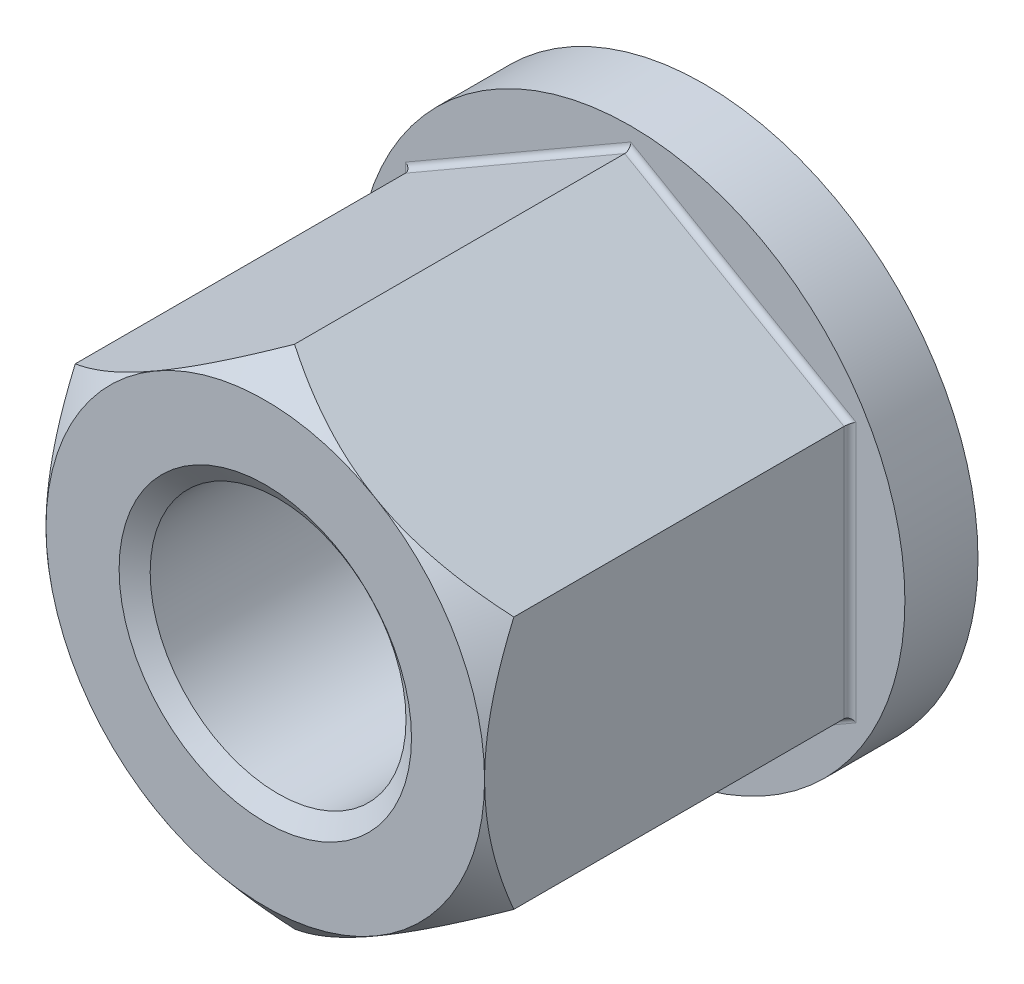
ISO-10303-21;
HEADER;
FILE_DESCRIPTION(('STEP AP214'),'2;1');
FILE_NAME('part.step','',(''),(''),'','','');
FILE_SCHEMA(('AUTOMOTIVE_DESIGN { 1 0 10303 214 1 1 1 1 }'));
ENDSEC;
DATA;
#1=APPLICATION_CONTEXT('core data for automotive mechanical design processes');
#2=APPLICATION_PROTOCOL_DEFINITION('international standard','automotive_design',2000,#1);
#3=PRODUCT_CONTEXT('',#1,'mechanical');
#4=PRODUCT('Part','Part','',(#3));
#5=PRODUCT_RELATED_PRODUCT_CATEGORY('part','',(#4));
#6=PRODUCT_DEFINITION_FORMATION('','',#4);
#7=PRODUCT_DEFINITION_CONTEXT('part definition',#1,'design');
#8=PRODUCT_DEFINITION('design','',#6,#7);
#9=PRODUCT_DEFINITION_SHAPE('','',#8);
#10=(LENGTH_UNIT() NAMED_UNIT(*) SI_UNIT(.MILLI.,.METRE.));
#11=(NAMED_UNIT(*) PLANE_ANGLE_UNIT() SI_UNIT($,.RADIAN.));
#12=(NAMED_UNIT(*) SI_UNIT($,.STERADIAN.) SOLID_ANGLE_UNIT());
#13=UNCERTAINTY_MEASURE_WITH_UNIT(LENGTH_MEASURE(1.E-05),#10,'distance_accuracy_value','');
#14=(GEOMETRIC_REPRESENTATION_CONTEXT(3) GLOBAL_UNCERTAINTY_ASSIGNED_CONTEXT((#13)) GLOBAL_UNIT_ASSIGNED_CONTEXT((#10,
#11,#12)) REPRESENTATION_CONTEXT('',''));
#15=CARTESIAN_POINT('',(0.,0.,0.));
#16=DIRECTION('',(0.,0.,1.));
#17=DIRECTION('',(1.,0.,0.));
#18=AXIS2_PLACEMENT_3D('',#15,#16,#17);
#19=CARTESIAN_POINT('',(0.,0.,-36.));
#20=DIRECTION('',(0.,0.,1.));
#21=DIRECTION('',(1.,0.,0.));
#22=AXIS2_PLACEMENT_3D('',#19,#20,#21);
#23=CYLINDRICAL_SURFACE('',#22,10.5);
#24=CARTESIAN_POINT('',(0.,0.,-1.05031130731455));
#25=DIRECTION('',(0.,0.,1.));
#26=DIRECTION('',(1.,0.,0.));
#27=AXIS2_PLACEMENT_3D('',#24,#25,#26);
#28=CIRCLE('',#27,10.5);
#29=CARTESIAN_POINT('',(10.5,0.,-1.05031130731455));
#30=VERTEX_POINT('',#29);
#31=EDGE_CURVE('E324',#30,#30,#28,.F.);
#32=ORIENTED_EDGE('',*,*,#31,.F.);
#33=EDGE_LOOP('',(#32));
#34=FACE_BOUND('',#33,.T.);
#35=CARTESIAN_POINT('',(0.,0.,-34.9242886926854));
#36=DIRECTION('',(0.,0.,-1.));
#37=DIRECTION('',(-1.,0.,0.));
#38=AXIS2_PLACEMENT_3D('',#35,#36,#37);
#39=CIRCLE('',#38,10.5);
#40=CARTESIAN_POINT('',(-10.5,0.,-34.9242886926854));
#41=VERTEX_POINT('',#40);
#42=EDGE_CURVE('E328',#41,#41,#39,.F.);
#43=ORIENTED_EDGE('',*,*,#42,.F.);
#44=EDGE_LOOP('',(#43));
#45=FACE_BOUND('',#44,.T.);
#46=ADVANCED_FACE('F43',(#34,#45),#23,.F.);
#47=CARTESIAN_POINT('',(0.,20.7846096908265,-36.));
#48=DIRECTION('',(-0.500000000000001,0.866025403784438,0.));
#49=DIRECTION('',(-0.866025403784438,-0.500000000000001,0.));
#50=AXIS2_PLACEMENT_3D('',#47,#48,#49);
#51=PLANE('',#50);
#52=DIRECTION('',(0.,0.,1.));
#53=VECTOR('',#52,1.);
#54=CARTESIAN_POINT('',(0.,20.7846096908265,-36.));
#55=LINE('',#54,#53);
#56=CARTESIAN_POINT('',(0.,20.7846096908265,-29.5));
#57=VERTEX_POINT('',#56);
#58=CARTESIAN_POINT('',(0.,20.7846096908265,-2.40000000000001));
#59=VERTEX_POINT('',#58);
#60=EDGE_CURVE('E143',#57,#59,#55,.T.);
#61=ORIENTED_EDGE('',*,*,#60,.F.);
#62=DIRECTION('',(-0.866025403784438,-0.500000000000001,0.));
#63=VECTOR('',#62,1.);
#64=CARTESIAN_POINT('',(0.,20.7846096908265,-29.5));
#65=LINE('',#64,#63);
#66=CARTESIAN_POINT('',(-18.,10.3923048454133,-29.5));
#67=VERTEX_POINT('',#66);
#68=EDGE_CURVE('E304',#57,#67,#65,.T.);
#69=ORIENTED_EDGE('',*,*,#68,.T.);
#70=DIRECTION('',(0.,0.,1.));
#71=VECTOR('',#70,1.);
#72=CARTESIAN_POINT('',(-18.,10.3923048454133,-36.));
#73=LINE('',#72,#71);
#74=CARTESIAN_POINT('',(-18.,10.3923048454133,-2.39999999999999));
#75=VERTEX_POINT('',#74);
#76=EDGE_CURVE('E411',#67,#75,#73,.T.);
#77=ORIENTED_EDGE('',*,*,#76,.T.);
#78=CARTESIAN_POINT('',(-18.0002,10.3921893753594,-2.4000995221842));
#79=CARTESIAN_POINT('',(-17.6472522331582,10.5959638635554,-2.22449760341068));
#80=CARTESIAN_POINT('',(-17.2918201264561,10.8011726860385,-2.05534790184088));
#81=CARTESIAN_POINT('',(-16.5756493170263,11.2146540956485,-1.7320405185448));
#82=CARTESIAN_POINT('',(-16.2149076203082,11.4229284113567,-1.57789170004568));
#83=CARTESIAN_POINT('',(-15.4863498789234,11.8435614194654,-1.286146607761));
#84=CARTESIAN_POINT('',(-15.1185072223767,12.055935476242,-1.14863831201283));
#85=CARTESIAN_POINT('',(-14.3777064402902,12.4836370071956,-0.893572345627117));
#86=CARTESIAN_POINT('',(-14.0047491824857,12.6989639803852,-0.77601133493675));
#87=CARTESIAN_POINT('',(-13.2607541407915,13.1285097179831,-0.565222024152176));
#88=CARTESIAN_POINT('',(-12.8898014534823,13.3426793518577,-0.471595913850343));
#89=CARTESIAN_POINT('',(-12.1439277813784,13.7733097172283,-0.308235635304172));
#90=CARTESIAN_POINT('',(-11.7690066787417,13.9897705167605,-0.238502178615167));
#91=CARTESIAN_POINT('',(-11.0170489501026,14.4239135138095,-0.124970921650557));
#92=CARTESIAN_POINT('',(-10.6400188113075,14.6415919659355,-0.0811162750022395));
#93=CARTESIAN_POINT('',(-9.88433556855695,15.0778858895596,-0.0204252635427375));
#94=CARTESIAN_POINT('',(-9.50568258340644,15.2965012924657,-0.00358695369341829));
#95=CARTESIAN_POINT('',(-8.80111206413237,15.7032852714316,0.00212894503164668));
#96=CARTESIAN_POINT('',(-8.47521263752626,15.8914433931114,-0.00541797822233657));
#97=CARTESIAN_POINT('',(-7.82424565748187,16.2672793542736,-0.0407036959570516));
#98=CARTESIAN_POINT('',(-7.4991780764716,16.4549572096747,-0.0684418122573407));
#99=CARTESIAN_POINT('',(-6.8505129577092,16.8294641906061,-0.143507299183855));
#100=CARTESIAN_POINT('',(-6.52691668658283,17.0162925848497,-0.190849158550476));
#101=CARTESIAN_POINT('',(-5.88218255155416,17.3885300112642,-0.304106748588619));
#102=CARTESIAN_POINT('',(-5.56104472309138,17.5739390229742,-0.370022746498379));
#103=CARTESIAN_POINT('',(-4.9217585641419,17.9430310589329,-0.519150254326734));
#104=CARTESIAN_POINT('',(-4.60361068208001,18.1267138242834,-0.602364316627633));
#105=CARTESIAN_POINT('',(-3.9707224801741,18.4921119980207,-0.784638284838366));
#106=CARTESIAN_POINT('',(-3.65598267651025,18.6738271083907,-0.883700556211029));
#107=CARTESIAN_POINT('',(-2.71756887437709,19.2156205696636,-1.20228324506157));
#108=CARTESIAN_POINT('',(-2.09929390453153,19.5725817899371,-1.44329801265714));
#109=CARTESIAN_POINT('',(-1.23771271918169,20.0700159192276,-1.81550682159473));
#110=CARTESIAN_POINT('',(-0.988042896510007,20.2141628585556,-1.9277719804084));
#111=CARTESIAN_POINT('',(-0.491802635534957,20.5006673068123,-2.15901832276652));
#112=CARTESIAN_POINT('',(-0.245225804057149,20.6430285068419,-2.27798119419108));
#113=CARTESIAN_POINT('',(0.000200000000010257,20.7847251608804,-2.40009952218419));
#114=B_SPLINE_CURVE_WITH_KNOTS('',3,(#78,#79,#80,#81,#82,#83,#84,#85,#86,#87,#88,#89,#90,#91,
#92,#93,#94,#95,#96,#97,#98,#99,#100,#101,#102,#103,#104,#105,#106,#107,#108,#109,#110,#111,
#112,#113),.UNSPECIFIED.,.F.,.F.,(4,2,2,2,2,2,2,2,2,2,2,2,2,2,2,2,2,4),(0.,1.33137657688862,
2.66353507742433,4.00245455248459,5.34114961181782,6.65588719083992,7.97066392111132,
9.28254170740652,10.594325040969,11.7229654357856,12.8515679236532,13.9810060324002,
15.1104603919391,16.2400815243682,17.3698714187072,19.6280163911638,20.556111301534,
21.4817815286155),.UNSPECIFIED.);
#115=CARTESIAN_POINT('',(-9.00000000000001,15.5884572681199,0.));
#116=VERTEX_POINT('',#115);
#117=EDGE_CURVE('E153',#75,#116,#114,.T.);
#118=ORIENTED_EDGE('',*,*,#117,.T.);
#119=EDGE_CURVE('E161',#116,#59,#114,.T.);
#120=ORIENTED_EDGE('',*,*,#119,.T.);
#121=EDGE_LOOP('',(#61,#69,#77,#118,#120));
#122=FACE_BOUND('',#121,.T.);
#123=ADVANCED_FACE('F238',(#122),#51,.T.);
#124=CARTESIAN_POINT('',(18.,10.3923048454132,-36.));
#125=DIRECTION('',(0.500000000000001,0.866025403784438,0.));
#126=DIRECTION('',(-0.866025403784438,0.500000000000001,0.));
#127=AXIS2_PLACEMENT_3D('',#124,#125,#126);
#128=PLANE('',#127);
#129=DIRECTION('',(0.,0.,1.));
#130=VECTOR('',#129,1.);
#131=CARTESIAN_POINT('',(18.,10.3923048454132,-36.));
#132=LINE('',#131,#130);
#133=CARTESIAN_POINT('',(18.,10.3923048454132,-29.5));
#134=VERTEX_POINT('',#133);
#135=CARTESIAN_POINT('',(18.,10.3923048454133,-2.40000000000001));
#136=VERTEX_POINT('',#135);
#137=EDGE_CURVE('E132',#134,#136,#132,.T.);
#138=ORIENTED_EDGE('',*,*,#137,.F.);
#139=DIRECTION('',(-0.866025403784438,0.500000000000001,0.));
#140=VECTOR('',#139,1.);
#141=CARTESIAN_POINT('',(18.,10.3923048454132,-29.5));
#142=LINE('',#141,#140);
#143=EDGE_CURVE('E357',#134,#57,#142,.T.);
#144=ORIENTED_EDGE('',*,*,#143,.T.);
#145=ORIENTED_EDGE('',*,*,#60,.T.);
#146=CARTESIAN_POINT('',(-0.000199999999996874,20.7847251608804,-2.40009952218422));
#147=CARTESIAN_POINT('',(0.352747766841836,20.5809506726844,-2.22449760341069));
#148=CARTESIAN_POINT('',(0.708179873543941,20.3757418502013,-2.05534790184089));
#149=CARTESIAN_POINT('',(1.42435068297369,19.9622604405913,-1.73204051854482));
#150=CARTESIAN_POINT('',(1.78509237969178,19.7539861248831,-1.57789170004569));
#151=CARTESIAN_POINT('',(2.51365012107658,19.3333531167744,-1.28614660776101));
#152=CARTESIAN_POINT('',(2.88149277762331,19.1209790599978,-1.14863831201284));
#153=CARTESIAN_POINT('',(3.62229355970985,18.6932775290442,-0.893572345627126));
#154=CARTESIAN_POINT('',(3.99525081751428,18.4779505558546,-0.776011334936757));
#155=CARTESIAN_POINT('',(4.7392458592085,18.0484048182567,-0.56522202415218));
#156=CARTESIAN_POINT('',(5.1101985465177,17.8342351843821,-0.471595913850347));
#157=CARTESIAN_POINT('',(5.85607221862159,17.4036048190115,-0.308235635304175));
#158=CARTESIAN_POINT('',(6.23099332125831,17.1871440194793,-0.23850217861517));
#159=CARTESIAN_POINT('',(6.98295104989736,16.7530010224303,-0.124970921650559));
#160=CARTESIAN_POINT('',(7.35998118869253,16.5353225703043,-0.0811162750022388));
#161=CARTESIAN_POINT('',(8.11566443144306,16.0990286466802,-0.0204252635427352));
#162=CARTESIAN_POINT('',(8.49431741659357,15.8804132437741,-0.00358695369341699));
#163=CARTESIAN_POINT('',(9.19888793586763,15.4736292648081,0.00212894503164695));
#164=CARTESIAN_POINT('',(9.52478736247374,15.2854711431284,-0.00541797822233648));
#165=CARTESIAN_POINT('',(10.1757543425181,14.9096351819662,-0.0407036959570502));
#166=CARTESIAN_POINT('',(10.5008219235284,14.7219573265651,-0.0684418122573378));
#167=CARTESIAN_POINT('',(11.1494870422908,14.3474503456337,-0.14350729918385));
#168=CARTESIAN_POINT('',(11.4730833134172,14.1606219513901,-0.19084915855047));
#169=CARTESIAN_POINT('',(12.1178174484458,13.7883845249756,-0.304106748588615));
#170=CARTESIAN_POINT('',(12.4389552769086,13.6029755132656,-0.370022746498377));
#171=CARTESIAN_POINT('',(13.0782414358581,13.2338834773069,-0.519150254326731));
#172=CARTESIAN_POINT('',(13.39638931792,13.0502007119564,-0.602364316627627));
#173=CARTESIAN_POINT('',(14.0292775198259,12.6848025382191,-0.784638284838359));
#174=CARTESIAN_POINT('',(14.3440173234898,12.503087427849,-0.883700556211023));
#175=CARTESIAN_POINT('',(15.2824311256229,11.9612939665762,-1.20228324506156));
#176=CARTESIAN_POINT('',(15.9007060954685,11.6043327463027,-1.44329801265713));
#177=CARTESIAN_POINT('',(16.7622872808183,11.1068986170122,-1.81550682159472));
#178=CARTESIAN_POINT('',(17.01195710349,10.9627516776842,-1.92777198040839));
#179=CARTESIAN_POINT('',(17.508197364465,10.6762472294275,-2.15901832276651));
#180=CARTESIAN_POINT('',(17.7547741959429,10.5338860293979,-2.27798119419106));
#181=CARTESIAN_POINT('',(18.0002,10.3921893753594,-2.40009952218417));
#182=B_SPLINE_CURVE_WITH_KNOTS('',3,(#146,#147,#148,#149,#150,#151,#152,#153,#154,#155,#156,
#157,#158,#159,#160,#161,#162,#163,#164,#165,#166,#167,#168,#169,#170,#171,#172,#173,#174,#175,
#176,#177,#178,#179,#180,#181),.UNSPECIFIED.,.F.,.F.,(4,2,2,2,2,2,2,2,2,2,2,2,2,2,2,2,2,4),(0.,
1.33137657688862,2.66353507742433,4.00245455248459,5.34114961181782,6.65588719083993,
7.97066392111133,9.28254170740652,10.594325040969,11.7229654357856,12.8515679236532,
13.9810060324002,15.1104603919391,16.2400815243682,17.3698714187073,19.6280163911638,
20.556111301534,21.4817815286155),.UNSPECIFIED.);
#183=CARTESIAN_POINT('',(9.00000000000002,15.5884572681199,0.));
#184=VERTEX_POINT('',#183);
#185=EDGE_CURVE('E159',#59,#184,#182,.T.);
#186=ORIENTED_EDGE('',*,*,#185,.T.);
#187=EDGE_CURVE('E148',#184,#136,#182,.T.);
#188=ORIENTED_EDGE('',*,*,#187,.T.);
#189=EDGE_LOOP('',(#138,#144,#145,#186,#188));
#190=FACE_BOUND('',#189,.T.);
#191=ADVANCED_FACE('F157',(#190),#128,.T.);
#192=CARTESIAN_POINT('',(18.,10.3923048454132,-36.));
#193=DIRECTION('',(-1.,0.,0.));
#194=DIRECTION('',(0.,0.,1.));
#195=AXIS2_PLACEMENT_3D('',#192,#193,#194);
#196=PLANE('',#195);
#197=DIRECTION('',(0.,0.,1.));
#198=VECTOR('',#197,1.);
#199=CARTESIAN_POINT('',(18.,-10.3923048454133,-36.));
#200=LINE('',#199,#198);
#201=CARTESIAN_POINT('',(18.,-10.3923048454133,-29.5));
#202=VERTEX_POINT('',#201);
#203=CARTESIAN_POINT('',(18.,-10.3923048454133,-2.40000000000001));
#204=VERTEX_POINT('',#203);
#205=EDGE_CURVE('E144',#202,#204,#200,.T.);
#206=ORIENTED_EDGE('',*,*,#205,.F.);
#207=DIRECTION('',(0.,-1.,0.));
#208=VECTOR('',#207,1.);
#209=CARTESIAN_POINT('',(18.,10.3923048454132,-29.5));
#210=LINE('',#209,#208);
#211=EDGE_CURVE('E139',#202,#134,#210,.F.);
#212=ORIENTED_EDGE('',*,*,#211,.T.);
#213=ORIENTED_EDGE('',*,*,#137,.T.);
#214=CARTESIAN_POINT('',(18.,-23.004007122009,-9.66109067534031));
#215=CARTESIAN_POINT('',(18.,-22.7130247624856,-9.46358121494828));
#216=CARTESIAN_POINT('',(18.,-22.4213849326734,-9.26704104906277));
#217=CARTESIAN_POINT('',(18.,-21.8366744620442,-8.87609133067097));
#218=CARTESIAN_POINT('',(18.,-21.5436037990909,-8.68168181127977));
#219=CARTESIAN_POINT('',(18.,-20.6619640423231,-8.1018666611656));
#220=CARTESIAN_POINT('',(18.,-20.0710871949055,-7.71995612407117));
#221=CARTESIAN_POINT('',(18.,-18.8779599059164,-6.96474937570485));
#222=CARTESIAN_POINT('',(18.,-18.275658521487,-6.59153346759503));
#223=CARTESIAN_POINT('',(18.,-17.0626062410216,-5.85913721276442));
#224=CARTESIAN_POINT('',(18.,-16.4518558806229,-5.4999559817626));
#225=CARTESIAN_POINT('',(18.,-15.187049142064,-4.77989017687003));
#226=CARTESIAN_POINT('',(18.,-14.53244086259,-4.41997024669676));
#227=CARTESIAN_POINT('',(18.,-13.2102587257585,-3.72436997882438));
#228=CARTESIAN_POINT('',(18.,-12.5426829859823,-3.38869319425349));
#229=CARTESIAN_POINT('',(18.,-11.1945975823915,-2.74913403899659));
#230=CARTESIAN_POINT('',(18.,-10.5141280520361,-2.44516764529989));
#231=CARTESIAN_POINT('',(18.,-9.13701896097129,-1.87650341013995));
#232=CARTESIAN_POINT('',(18.,-8.4403862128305,-1.61178935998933));
#233=CARTESIAN_POINT('',(18.,-7.39269202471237,-1.25527340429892));
#234=CARTESIAN_POINT('',(18.,-7.04803834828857,-1.14452672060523));
#235=CARTESIAN_POINT('',(18.,-6.35479865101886,-0.936059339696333));
#236=CARTESIAN_POINT('',(18.,-6.00621274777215,-0.838338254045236));
#237=CARTESIAN_POINT('',(18.,-5.30529131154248,-0.65725116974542));
#238=CARTESIAN_POINT('',(18.,-4.95295551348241,-0.573886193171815));
#239=CARTESIAN_POINT('',(18.,-4.24494415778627,-0.422830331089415));
#240=CARTESIAN_POINT('',(18.,-3.88926880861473,-0.355138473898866));
#241=CARTESIAN_POINT('',(18.,-3.1817425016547,-0.237715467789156));
#242=CARTESIAN_POINT('',(18.,-2.82994329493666,-0.187673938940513));
#243=CARTESIAN_POINT('',(18.,-2.12431777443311,-0.10476176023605));
#244=CARTESIAN_POINT('',(18.,-1.77049147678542,-0.0718909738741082));
#245=CARTESIAN_POINT('',(18.,-1.06165755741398,-0.023977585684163));
#246=CARTESIAN_POINT('',(18.,-0.706650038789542,-0.00893346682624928));
#247=CARTESIAN_POINT('',(18.,0.00366918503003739,0.0030183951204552));
#248=CARTESIAN_POINT('',(18.,0.358980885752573,-7.35995509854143E-05));
#249=CARTESIAN_POINT('',(18.,1.04524350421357,-0.023514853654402));
#250=CARTESIAN_POINT('',(18.,1.37623509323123,-0.0426966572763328));
#251=CARTESIAN_POINT('',(18.,2.03695728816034,-0.0964469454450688));
#252=CARTESIAN_POINT('',(18.,2.36668791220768,-0.131015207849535));
#253=CARTESIAN_POINT('',(18.,3.02426460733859,-0.214948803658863));
#254=CARTESIAN_POINT('',(18.,3.35211059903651,-0.264314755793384));
#255=CARTESIAN_POINT('',(18.,4.00537756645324,-0.377054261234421));
#256=CARTESIAN_POINT('',(18.,4.33079851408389,-0.440427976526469));
#257=CARTESIAN_POINT('',(18.,4.98553766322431,-0.581709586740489));
#258=CARTESIAN_POINT('',(18.,5.31479639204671,-0.659892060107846));
#259=CARTESIAN_POINT('',(18.,5.97006378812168,-0.828821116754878));
#260=CARTESIAN_POINT('',(18.,6.29607242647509,-0.919567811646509));
#261=CARTESIAN_POINT('',(18.,6.94458276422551,-1.1125074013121));
#262=CARTESIAN_POINT('',(18.,7.26708534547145,-1.21469734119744));
#263=CARTESIAN_POINT('',(18.,7.90858491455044,-1.42946670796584));
#264=CARTESIAN_POINT('',(18.,8.22758199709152,-1.54204585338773));
#265=CARTESIAN_POINT('',(18.,9.12558604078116,-1.8739550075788));
#266=CARTESIAN_POINT('',(18.,9.7005376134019,-2.10430079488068));
#267=CARTESIAN_POINT('',(18.,10.8394982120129,-2.59076896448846));
#268=CARTESIAN_POINT('',(18.,11.4035040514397,-2.8468987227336));
#269=CARTESIAN_POINT('',(18.,12.5220422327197,-3.38049628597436));
#270=CARTESIAN_POINT('',(18.,13.0765634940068,-3.65798720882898));
#271=CARTESIAN_POINT('',(18.,14.1765320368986,-4.23020882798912));
#272=CARTESIAN_POINT('',(18.,14.7219801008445,-4.52493802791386));
#273=CARTESIAN_POINT('',(18.,15.80820393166,-5.13042229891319));
#274=CARTESIAN_POINT('',(18.,16.3489315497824,-5.44126344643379));
#275=CARTESIAN_POINT('',(18.,17.4233654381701,-6.07483951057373));
#276=CARTESIAN_POINT('',(18.,17.9570715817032,-6.39757464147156));
#277=CARTESIAN_POINT('',(18.,19.0180561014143,-7.05276792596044));
#278=CARTESIAN_POINT('',(18.,19.5453379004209,-7.38522054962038));
#279=CARTESIAN_POINT('',(18.,20.5945560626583,-8.0584316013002));
#280=CARTESIAN_POINT('',(18.,21.1164924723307,-8.39918995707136));
#281=CARTESIAN_POINT('',(18.,22.1043731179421,-9.05372841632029));
#282=CARTESIAN_POINT('',(18.,22.5707554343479,-9.36684845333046));
#283=CARTESIAN_POINT('',(18.,23.5001598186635,-9.99803991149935));
#284=CARTESIAN_POINT('',(18.,23.9631818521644,-10.3161113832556));
#285=CARTESIAN_POINT('',(18.,25.3478989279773,-11.2768419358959));
#286=CARTESIAN_POINT('',(18.,26.2651309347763,-11.925941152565));
#287=CARTESIAN_POINT('',(18.,27.6278073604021,-12.9051375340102));
#288=CARTESIAN_POINT('',(18.,28.076854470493,-13.2302516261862));
#289=CARTESIAN_POINT('',(18.,28.9728653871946,-13.8833432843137));
#290=CARTESIAN_POINT('',(18.,29.4198291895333,-14.2113208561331));
#291=CARTESIAN_POINT('',(18.,30.3117649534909,-14.8697271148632));
#292=CARTESIAN_POINT('',(18.,30.7567374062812,-15.2001551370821));
#293=CARTESIAN_POINT('',(18.,31.6449810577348,-15.8632811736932));
#294=CARTESIAN_POINT('',(18.,32.0882522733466,-16.1959791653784));
#295=CARTESIAN_POINT('',(18.,32.5307636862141,-16.5296824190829));
#296=B_SPLINE_CURVE_WITH_KNOTS('',3,(#214,#215,#216,#217,#218,#219,#220,#221,#222,#223,#224,
#225,#226,#227,#228,#229,#230,#231,#232,#233,#234,#235,#236,#237,#238,#239,#240,#241,#242,#243,
#244,#245,#246,#247,#248,#249,#250,#251,#252,#253,#254,#255,#256,#257,#258,#259,#260,#261,#262,
#263,#264,#265,#266,#267,#268,#269,#270,#271,#272,#273,#274,#275,#276,#277,#278,#279,#280,#281,
#282,#283,#284,#285,#286,#287,#288,#289,#290,#291,#292,#293,#294,#295),.UNSPECIFIED.,.F.,.F.,(4,
2,2,2,2,2,2,2,2,2,2,2,2,2,2,2,2,2,2,2,2,2,2,2,2,2,2,2,2,2,2,2,2,2,2,2,2,2,2,2,4),(0.,
1.05504447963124,2.11010533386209,4.22066252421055,6.34618802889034,8.4715793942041,
10.7122708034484,12.9532899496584,15.1882116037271,17.4222077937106,18.5080274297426,
19.5938146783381,20.6796791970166,21.7654763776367,22.8310967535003,23.8967086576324,
24.9622298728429,26.0277356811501,27.0220130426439,28.0162760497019,29.0105806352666,
30.0048967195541,31.0198683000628,32.0348488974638,33.0495680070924,34.0642596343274,
35.9215460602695,37.779365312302,39.6392242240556,41.4989219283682,43.3698570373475,
45.2408258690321,47.1107499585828,48.9806577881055,50.6658546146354,52.3510686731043,
55.7219077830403,57.3850561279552,59.0482078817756,60.7109238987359,62.3736233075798),.UNSPECIFIED.);
#297=CARTESIAN_POINT('',(18.,0.,0.));
#298=VERTEX_POINT('',#297);
#299=EDGE_CURVE('E137',#298,#136,#296,.T.);
#300=ORIENTED_EDGE('',*,*,#299,.F.);
#301=EDGE_CURVE('E155',#204,#298,#296,.T.);
#302=ORIENTED_EDGE('',*,*,#301,.F.);
#303=EDGE_LOOP('',(#206,#212,#213,#300,#302));
#304=FACE_BOUND('',#303,.T.);
#305=ADVANCED_FACE('F135',(#304),#196,.F.);
#306=CARTESIAN_POINT('',(0.,-20.7846096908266,-36.));
#307=DIRECTION('',(0.500000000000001,-0.866025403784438,0.));
#308=DIRECTION('',(0.866025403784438,0.500000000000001,0.));
#309=AXIS2_PLACEMENT_3D('',#306,#307,#308);
#310=PLANE('',#309);
#311=DIRECTION('',(0.,0.,1.));
#312=VECTOR('',#311,1.);
#313=CARTESIAN_POINT('',(0.,-20.7846096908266,-36.));
#314=LINE('',#313,#312);
#315=CARTESIAN_POINT('',(0.,-20.7846096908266,-29.5));
#316=VERTEX_POINT('',#315);
#317=CARTESIAN_POINT('',(0.,-20.7846096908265,-2.40000000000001));
#318=VERTEX_POINT('',#317);
#319=EDGE_CURVE('E319',#316,#318,#314,.T.);
#320=ORIENTED_EDGE('',*,*,#319,.F.);
#321=DIRECTION('',(0.866025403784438,0.500000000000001,0.));
#322=VECTOR('',#321,1.);
#323=CARTESIAN_POINT('',(0.,-20.7846096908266,-29.5));
#324=LINE('',#323,#322);
#325=EDGE_CURVE('E354',#316,#202,#324,.T.);
#326=ORIENTED_EDGE('',*,*,#325,.T.);
#327=ORIENTED_EDGE('',*,*,#205,.T.);
#328=CARTESIAN_POINT('',(18.0002,-10.3921893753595,-2.40009952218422));
#329=CARTESIAN_POINT('',(17.6472522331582,-10.5959638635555,-2.2244976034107));
#330=CARTESIAN_POINT('',(17.2918201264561,-10.8011726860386,-2.0553479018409));
#331=CARTESIAN_POINT('',(16.5756493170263,-11.2146540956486,-1.73204051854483));
#332=CARTESIAN_POINT('',(16.2149076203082,-11.4229284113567,-1.5778917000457));
#333=CARTESIAN_POINT('',(15.4863498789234,-11.8435614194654,-1.28614660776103));
#334=CARTESIAN_POINT('',(15.1185072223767,-12.0559354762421,-1.14863831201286));
#335=CARTESIAN_POINT('',(14.3777064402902,-12.4836370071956,-0.893572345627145));
#336=CARTESIAN_POINT('',(14.0047491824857,-12.6989639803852,-0.776011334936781));
#337=CARTESIAN_POINT('',(13.2607541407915,-13.1285097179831,-0.565222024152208));
#338=CARTESIAN_POINT('',(12.8898014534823,-13.3426793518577,-0.471595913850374));
#339=CARTESIAN_POINT('',(12.1439277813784,-13.7733097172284,-0.308235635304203));
#340=CARTESIAN_POINT('',(11.7690066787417,-13.9897705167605,-0.2385021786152));
#341=CARTESIAN_POINT('',(11.0170489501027,-14.4239135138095,-0.124970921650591));
#342=CARTESIAN_POINT('',(10.6400188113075,-14.6415919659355,-0.0811162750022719));
#343=CARTESIAN_POINT('',(9.88433556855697,-15.0778858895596,-0.020425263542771));
#344=CARTESIAN_POINT('',(9.50568258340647,-15.2965012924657,-0.00358695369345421));
#345=CARTESIAN_POINT('',(8.8011120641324,-15.7032852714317,0.00212894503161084));
#346=CARTESIAN_POINT('',(8.47521263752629,-15.8914433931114,-0.00541797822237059));
#347=CARTESIAN_POINT('',(7.8242456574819,-16.2672793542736,-0.0407036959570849));
#348=CARTESIAN_POINT('',(7.49917807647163,-16.4549572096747,-0.0684418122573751));
#349=CARTESIAN_POINT('',(6.85051295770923,-16.8294641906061,-0.143507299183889));
#350=CARTESIAN_POINT('',(6.52691668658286,-17.0162925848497,-0.190849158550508));
#351=CARTESIAN_POINT('',(5.88218255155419,-17.3885300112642,-0.30410674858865));
#352=CARTESIAN_POINT('',(5.56104472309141,-17.5739390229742,-0.370022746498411));
#353=CARTESIAN_POINT('',(4.92175856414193,-17.9430310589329,-0.519150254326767));
#354=CARTESIAN_POINT('',(4.60361068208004,-18.1267138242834,-0.602364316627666));
#355=CARTESIAN_POINT('',(3.97072248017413,-18.4921119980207,-0.784638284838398));
#356=CARTESIAN_POINT('',(3.65598267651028,-18.6738271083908,-0.883700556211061));
#357=CARTESIAN_POINT('',(2.71756887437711,-19.2156205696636,-1.20228324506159));
#358=CARTESIAN_POINT('',(2.09929390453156,-19.5725817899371,-1.44329801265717));
#359=CARTESIAN_POINT('',(1.23771271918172,-20.0700159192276,-1.81550682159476));
#360=CARTESIAN_POINT('',(0.988042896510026,-20.2141628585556,-1.92777198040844));
#361=CARTESIAN_POINT('',(0.491802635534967,-20.5006673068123,-2.15901832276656));
#362=CARTESIAN_POINT('',(0.245225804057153,-20.6430285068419,-2.27798119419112));
#363=CARTESIAN_POINT('',(-0.000200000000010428,-20.7847251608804,-2.40009952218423));
#364=B_SPLINE_CURVE_WITH_KNOTS('',3,(#328,#329,#330,#331,#332,#333,#334,#335,#336,#337,#338,
#339,#340,#341,#342,#343,#344,#345,#346,#347,#348,#349,#350,#351,#352,#353,#354,#355,#356,#357,
#358,#359,#360,#361,#362,#363),.UNSPECIFIED.,.F.,.F.,(4,2,2,2,2,2,2,2,2,2,2,2,2,2,2,2,2,4),(0.,
1.33137657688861,2.66353507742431,4.00245455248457,5.3411496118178,6.65588719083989,
7.97066392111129,9.28254170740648,10.594325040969,11.7229654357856,12.8515679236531,
13.9810060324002,15.1104603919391,16.2400815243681,17.3698714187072,19.6280163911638,
20.556111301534,21.4817815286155),.UNSPECIFIED.);
#365=CARTESIAN_POINT('',(9.00000000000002,-15.5884572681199,0.));
#366=VERTEX_POINT('',#365);
#367=EDGE_CURVE('E224',#204,#366,#364,.T.);
#368=ORIENTED_EDGE('',*,*,#367,.T.);
#369=EDGE_CURVE('E214',#366,#318,#364,.T.);
#370=ORIENTED_EDGE('',*,*,#369,.T.);
#371=EDGE_LOOP('',(#320,#326,#327,#368,#370));
#372=FACE_BOUND('',#371,.T.);
#373=ADVANCED_FACE('F227',(#372),#310,.T.);
#374=CARTESIAN_POINT('',(-18.,-10.3923048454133,-36.));
#375=DIRECTION('',(-0.500000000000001,-0.866025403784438,0.));
#376=DIRECTION('',(0.866025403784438,-0.500000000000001,0.));
#377=AXIS2_PLACEMENT_3D('',#374,#375,#376);
#378=PLANE('',#377);
#379=DIRECTION('',(0.,0.,1.));
#380=VECTOR('',#379,1.);
#381=CARTESIAN_POINT('',(-18.,-10.3923048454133,-36.));
#382=LINE('',#381,#380);
#383=CARTESIAN_POINT('',(-18.,-10.3923048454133,-29.5));
#384=VERTEX_POINT('',#383);
#385=CARTESIAN_POINT('',(-18.,-10.3923048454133,-2.40000000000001));
#386=VERTEX_POINT('',#385);
#387=EDGE_CURVE('E414',#384,#386,#382,.T.);
#388=ORIENTED_EDGE('',*,*,#387,.F.);
#389=DIRECTION('',(0.866025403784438,-0.500000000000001,0.));
#390=VECTOR('',#389,1.);
#391=CARTESIAN_POINT('',(-18.,-10.3923048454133,-29.5));
#392=LINE('',#391,#390);
#393=EDGE_CURVE('E52',#384,#316,#392,.T.);
#394=ORIENTED_EDGE('',*,*,#393,.T.);
#395=ORIENTED_EDGE('',*,*,#319,.T.);
#396=CARTESIAN_POINT('',(0.000199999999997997,-20.7847251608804,-2.40009952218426));
#397=CARTESIAN_POINT('',(-0.352747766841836,-20.5809506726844,-2.22449760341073));
#398=CARTESIAN_POINT('',(-0.708179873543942,-20.3757418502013,-2.05534790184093));
#399=CARTESIAN_POINT('',(-1.42435068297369,-19.9622604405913,-1.73204051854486));
#400=CARTESIAN_POINT('',(-1.78509237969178,-19.7539861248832,-1.57789170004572));
#401=CARTESIAN_POINT('',(-2.51365012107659,-19.3333531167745,-1.28614660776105));
#402=CARTESIAN_POINT('',(-2.88149277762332,-19.1209790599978,-1.14863831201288));
#403=CARTESIAN_POINT('',(-3.62229355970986,-18.6932775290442,-0.893572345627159));
#404=CARTESIAN_POINT('',(-3.9952508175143,-18.4779505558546,-0.776011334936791));
#405=CARTESIAN_POINT('',(-4.73924585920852,-18.0484048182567,-0.565222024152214));
#406=CARTESIAN_POINT('',(-5.11019854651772,-17.8342351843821,-0.471595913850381));
#407=CARTESIAN_POINT('',(-5.85607221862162,-17.4036048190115,-0.308235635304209));
#408=CARTESIAN_POINT('',(-6.23099332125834,-17.1871440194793,-0.238502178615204));
#409=CARTESIAN_POINT('',(-6.98295104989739,-16.7530010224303,-0.124970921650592));
#410=CARTESIAN_POINT('',(-7.35998118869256,-16.5353225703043,-0.0811162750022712));
#411=CARTESIAN_POINT('',(-8.1156644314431,-16.0990286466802,-0.0204252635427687));
#412=CARTESIAN_POINT('',(-8.4943174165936,-15.8804132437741,-0.00358695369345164));
#413=CARTESIAN_POINT('',(-9.19888793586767,-15.4736292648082,0.00212894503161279));
#414=CARTESIAN_POINT('',(-9.52478736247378,-15.2854711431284,-0.00541797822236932));
#415=CARTESIAN_POINT('',(-10.1757543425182,-14.9096351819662,-0.0407036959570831));
#416=CARTESIAN_POINT('',(-10.5008219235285,-14.7219573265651,-0.068441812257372));
#417=CARTESIAN_POINT('',(-11.1494870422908,-14.3474503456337,-0.143507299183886));
#418=CARTESIAN_POINT('',(-11.4730833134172,-14.1606219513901,-0.190849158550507));
#419=CARTESIAN_POINT('',(-12.1178174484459,-13.7883845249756,-0.304106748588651));
#420=CARTESIAN_POINT('',(-12.4389552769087,-13.6029755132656,-0.370022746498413));
#421=CARTESIAN_POINT('',(-13.0782414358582,-13.2338834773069,-0.519150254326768));
#422=CARTESIAN_POINT('',(-13.3963893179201,-13.0502007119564,-0.602364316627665));
#423=CARTESIAN_POINT('',(-14.029277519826,-12.6848025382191,-0.784638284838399));
#424=CARTESIAN_POINT('',(-14.3440173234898,-12.5030874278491,-0.883700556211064));
#425=CARTESIAN_POINT('',(-15.282431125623,-11.9612939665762,-1.2022832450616));
#426=CARTESIAN_POINT('',(-15.9007060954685,-11.6043327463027,-1.44329801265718));
#427=CARTESIAN_POINT('',(-16.7622872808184,-11.1068986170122,-1.81550682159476));
#428=CARTESIAN_POINT('',(-17.01195710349,-10.9627516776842,-1.92777198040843));
#429=CARTESIAN_POINT('',(-17.5081973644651,-10.6762472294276,-2.15901832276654));
#430=CARTESIAN_POINT('',(-17.7547741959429,-10.5338860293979,-2.27798119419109));
#431=CARTESIAN_POINT('',(-18.0002,-10.3921893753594,-2.40009952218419));
#432=B_SPLINE_CURVE_WITH_KNOTS('',3,(#396,#397,#398,#399,#400,#401,#402,#403,#404,#405,#406,
#407,#408,#409,#410,#411,#412,#413,#414,#415,#416,#417,#418,#419,#420,#421,#422,#423,#424,#425,
#426,#427,#428,#429,#430,#431),.UNSPECIFIED.,.F.,.F.,(4,2,2,2,2,2,2,2,2,2,2,2,2,2,2,2,2,4),(0.,
1.33137657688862,2.66353507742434,4.00245455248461,5.34114961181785,6.65588719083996,
7.97066392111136,9.28254170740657,10.5943250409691,11.7229654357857,12.8515679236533,
13.9810060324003,15.1104603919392,16.2400815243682,17.3698714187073,19.6280163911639,
20.5561113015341,21.4817815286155),.UNSPECIFIED.);
#433=CARTESIAN_POINT('',(-9.00000000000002,-15.5884572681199,0.));
#434=VERTEX_POINT('',#433);
#435=EDGE_CURVE('E318',#318,#434,#432,.T.);
#436=ORIENTED_EDGE('',*,*,#435,.T.);
#437=EDGE_CURVE('E206',#434,#386,#432,.T.);
#438=ORIENTED_EDGE('',*,*,#437,.T.);
#439=EDGE_LOOP('',(#388,#394,#395,#436,#438));
#440=FACE_BOUND('',#439,.T.);
#441=ADVANCED_FACE('F230',(#440),#378,.T.);
#442=CARTESIAN_POINT('',(-18.,10.3923048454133,-36.));
#443=DIRECTION('',(-1.,0.,0.));
#444=DIRECTION('',(0.,0.,1.));
#445=AXIS2_PLACEMENT_3D('',#442,#443,#444);
#446=PLANE('',#445);
#447=ORIENTED_EDGE('',*,*,#76,.F.);
#448=DIRECTION('',(0.,-1.,0.));
#449=VECTOR('',#448,1.);
#450=CARTESIAN_POINT('',(-18.,10.3923048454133,-29.5));
#451=LINE('',#450,#449);
#452=EDGE_CURVE('E12',#67,#384,#451,.T.);
#453=ORIENTED_EDGE('',*,*,#452,.T.);
#454=ORIENTED_EDGE('',*,*,#387,.T.);
#455=CARTESIAN_POINT('',(-18.,-23.0040071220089,-9.6610906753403));
#456=CARTESIAN_POINT('',(-18.,-22.7130247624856,-9.46358121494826));
#457=CARTESIAN_POINT('',(-18.,-22.4213849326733,-9.26704104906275));
#458=CARTESIAN_POINT('',(-18.,-21.8366744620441,-8.87609133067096));
#459=CARTESIAN_POINT('',(-18.,-21.5436037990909,-8.68168181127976));
#460=CARTESIAN_POINT('',(-18.,-20.6619640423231,-8.10186666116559));
#461=CARTESIAN_POINT('',(-18.,-20.0710871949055,-7.71995612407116));
#462=CARTESIAN_POINT('',(-18.,-18.8779599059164,-6.96474937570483));
#463=CARTESIAN_POINT('',(-18.,-18.275658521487,-6.59153346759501));
#464=CARTESIAN_POINT('',(-18.,-17.0626062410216,-5.85913721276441));
#465=CARTESIAN_POINT('',(-18.,-16.4518558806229,-5.49995598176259));
#466=CARTESIAN_POINT('',(-18.,-15.187049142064,-4.77989017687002));
#467=CARTESIAN_POINT('',(-18.,-14.53244086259,-4.41997024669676));
#468=CARTESIAN_POINT('',(-18.,-13.2102587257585,-3.72436997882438));
#469=CARTESIAN_POINT('',(-18.,-12.5426829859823,-3.38869319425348));
#470=CARTESIAN_POINT('',(-18.,-11.1945975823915,-2.74913403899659));
#471=CARTESIAN_POINT('',(-18.,-10.5141280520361,-2.44516764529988));
#472=CARTESIAN_POINT('',(-18.,-9.13701896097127,-1.87650341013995));
#473=CARTESIAN_POINT('',(-18.,-8.44038621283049,-1.61178935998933));
#474=CARTESIAN_POINT('',(-18.,-7.39269202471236,-1.25527340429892));
#475=CARTESIAN_POINT('',(-18.,-7.04803834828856,-1.14452672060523));
#476=CARTESIAN_POINT('',(-18.,-6.35479865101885,-0.93605933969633));
#477=CARTESIAN_POINT('',(-18.,-6.00621274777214,-0.838338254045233));
#478=CARTESIAN_POINT('',(-18.,-5.30529131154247,-0.657251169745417));
#479=CARTESIAN_POINT('',(-18.,-4.95295551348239,-0.573886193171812));
#480=CARTESIAN_POINT('',(-18.,-4.24494415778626,-0.422830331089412));
#481=CARTESIAN_POINT('',(-18.,-3.88926880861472,-0.355138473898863));
#482=CARTESIAN_POINT('',(-18.,-3.18174250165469,-0.237715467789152));
#483=CARTESIAN_POINT('',(-18.,-2.82994329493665,-0.187673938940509));
#484=CARTESIAN_POINT('',(-18.,-2.1243177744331,-0.104761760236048));
#485=CARTESIAN_POINT('',(-18.,-1.77049147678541,-0.0718909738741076));
#486=CARTESIAN_POINT('',(-18.,-1.06165755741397,-0.0239775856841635));
#487=CARTESIAN_POINT('',(-18.,-0.706650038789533,-0.00893346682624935));
#488=CARTESIAN_POINT('',(-18.,0.00366918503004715,0.00301839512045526));
#489=CARTESIAN_POINT('',(-18.,0.358980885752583,-7.3599550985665E-05));
#490=CARTESIAN_POINT('',(-18.,1.04524350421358,-0.0235148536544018));
#491=CARTESIAN_POINT('',(-18.,1.37623509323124,-0.0426966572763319));
#492=CARTESIAN_POINT('',(-18.,2.03695728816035,-0.0964469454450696));
#493=CARTESIAN_POINT('',(-18.,2.36668791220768,-0.131015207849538));
#494=CARTESIAN_POINT('',(-18.,3.02426460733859,-0.214948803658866));
#495=CARTESIAN_POINT('',(-18.,3.35211059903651,-0.264314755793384));
#496=CARTESIAN_POINT('',(-18.,4.00537756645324,-0.377054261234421));
#497=CARTESIAN_POINT('',(-18.,4.3307985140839,-0.440427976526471));
#498=CARTESIAN_POINT('',(-18.,4.98553766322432,-0.581709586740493));
#499=CARTESIAN_POINT('',(-18.,5.31479639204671,-0.659892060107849));
#500=CARTESIAN_POINT('',(-18.,5.97006378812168,-0.828821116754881));
#501=CARTESIAN_POINT('',(-18.,6.29607242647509,-0.919567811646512));
#502=CARTESIAN_POINT('',(-18.,6.94458276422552,-1.1125074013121));
#503=CARTESIAN_POINT('',(-18.,7.26708534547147,-1.21469734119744));
#504=CARTESIAN_POINT('',(-18.,7.90858491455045,-1.42946670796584));
#505=CARTESIAN_POINT('',(-18.,8.22758199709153,-1.54204585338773));
#506=CARTESIAN_POINT('',(-18.,9.12558604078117,-1.87395500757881));
#507=CARTESIAN_POINT('',(-18.,9.70053761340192,-2.10430079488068));
#508=CARTESIAN_POINT('',(-18.,10.8394982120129,-2.59076896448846));
#509=CARTESIAN_POINT('',(-18.,11.4035040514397,-2.8468987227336));
#510=CARTESIAN_POINT('',(-18.,12.5220422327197,-3.38049628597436));
#511=CARTESIAN_POINT('',(-18.,13.0765634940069,-3.65798720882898));
#512=CARTESIAN_POINT('',(-18.,14.1765320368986,-4.23020882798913));
#513=CARTESIAN_POINT('',(-18.,14.7219801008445,-4.52493802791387));
#514=CARTESIAN_POINT('',(-18.,15.8082039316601,-5.1304222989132));
#515=CARTESIAN_POINT('',(-18.,16.3489315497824,-5.4412634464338));
#516=CARTESIAN_POINT('',(-18.,17.4233654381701,-6.07483951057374));
#517=CARTESIAN_POINT('',(-18.,17.9570715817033,-6.39757464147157));
#518=CARTESIAN_POINT('',(-18.,19.0180561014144,-7.05276792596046));
#519=CARTESIAN_POINT('',(-18.,19.545337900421,-7.3852205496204));
#520=CARTESIAN_POINT('',(-18.,20.5945560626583,-8.05843160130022));
#521=CARTESIAN_POINT('',(-18.,21.1164924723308,-8.39918995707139));
#522=CARTESIAN_POINT('',(-18.,22.1043731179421,-9.05372841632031));
#523=CARTESIAN_POINT('',(-18.,22.570755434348,-9.36684845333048));
#524=CARTESIAN_POINT('',(-18.,23.5001598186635,-9.99803991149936));
#525=CARTESIAN_POINT('',(-18.,23.9631818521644,-10.3161113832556));
#526=CARTESIAN_POINT('',(-18.,25.3478989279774,-11.2768419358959));
#527=CARTESIAN_POINT('',(-18.,26.2651309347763,-11.925941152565));
#528=CARTESIAN_POINT('',(-18.,27.6278073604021,-12.9051375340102));
#529=CARTESIAN_POINT('',(-18.,28.076854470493,-13.2302516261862));
#530=CARTESIAN_POINT('',(-18.,28.9728653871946,-13.8833432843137));
#531=CARTESIAN_POINT('',(-18.,29.4198291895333,-14.2113208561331));
#532=CARTESIAN_POINT('',(-18.,30.3117649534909,-14.8697271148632));
#533=CARTESIAN_POINT('',(-18.,30.7567374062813,-15.2001551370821));
#534=CARTESIAN_POINT('',(-18.,31.6449810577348,-15.8632811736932));
#535=CARTESIAN_POINT('',(-18.,32.0882522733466,-16.1959791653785));
#536=CARTESIAN_POINT('',(-18.,32.5307636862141,-16.5296824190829));
#537=B_SPLINE_CURVE_WITH_KNOTS('',3,(#455,#456,#457,#458,#459,#460,#461,#462,#463,#464,#465,
#466,#467,#468,#469,#470,#471,#472,#473,#474,#475,#476,#477,#478,#479,#480,#481,#482,#483,#484,
#485,#486,#487,#488,#489,#490,#491,#492,#493,#494,#495,#496,#497,#498,#499,#500,#501,#502,#503,
#504,#505,#506,#507,#508,#509,#510,#511,#512,#513,#514,#515,#516,#517,#518,#519,#520,#521,#522,
#523,#524,#525,#526,#527,#528,#529,#530,#531,#532,#533,#534,#535,#536),.UNSPECIFIED.,.F.,.F.,(4,
2,2,2,2,2,2,2,2,2,2,2,2,2,2,2,2,2,2,2,2,2,2,2,2,2,2,2,2,2,2,2,2,2,2,2,2,2,2,2,4),(0.,
1.05504447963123,2.11010533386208,4.22066252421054,6.34618802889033,8.47157939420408,
10.7122708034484,12.9532899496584,15.1882116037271,17.4222077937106,18.5080274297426,
19.5938146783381,20.6796791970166,21.7654763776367,22.8310967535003,23.8967086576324,
24.9622298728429,26.02773568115,27.0220130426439,28.0162760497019,29.0105806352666,
30.0048967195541,31.0198683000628,32.0348488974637,33.0495680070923,34.0642596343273,
35.9215460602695,37.779365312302,39.6392242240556,41.4989219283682,43.3698570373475,
45.2408258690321,47.1107499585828,48.9806577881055,50.6658546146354,52.3510686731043,
55.7219077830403,57.3850561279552,59.0482078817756,60.7109238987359,62.3736233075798),.UNSPECIFIED.);
#538=CARTESIAN_POINT('',(-18.,0.,0.));
#539=VERTEX_POINT('',#538);
#540=EDGE_CURVE('E322',#386,#539,#537,.T.);
#541=ORIENTED_EDGE('',*,*,#540,.T.);
#542=EDGE_CURVE('E196',#539,#75,#537,.T.);
#543=ORIENTED_EDGE('',*,*,#542,.T.);
#544=EDGE_LOOP('',(#447,#453,#454,#541,#543));
#545=FACE_BOUND('',#544,.T.);
#546=ADVANCED_FACE('F234',(#545),#446,.T.);
#547=CARTESIAN_POINT('',(-36.,0.,0.));
#548=DIRECTION('',(0.,0.,1.));
#549=DIRECTION('',(1.,0.,0.));
#550=AXIS2_PLACEMENT_3D('',#547,#548,#549);
#551=PLANE('',#550);
#552=CARTESIAN_POINT('',(0.,0.,0.));
#553=DIRECTION('',(0.,0.,1.));
#554=DIRECTION('',(1.,0.,0.));
#555=AXIS2_PLACEMENT_3D('',#552,#553,#554);
#556=CIRCLE('',#555,12.);
#557=CARTESIAN_POINT('',(12.,0.,0.));
#558=VERTEX_POINT('',#557);
#559=EDGE_CURVE('E286',#558,#558,#556,.T.);
#560=ORIENTED_EDGE('',*,*,#559,.F.);
#561=EDGE_LOOP('',(#560));
#562=FACE_BOUND('',#561,.T.);
#563=CARTESIAN_POINT('',(0.,0.,0.));
#564=DIRECTION('',(0.,0.,1.));
#565=DIRECTION('',(1.,0.,0.));
#566=AXIS2_PLACEMENT_3D('',#563,#564,#565);
#567=CIRCLE('',#566,18.);
#568=EDGE_CURVE('E290',#366,#298,#567,.T.);
#569=ORIENTED_EDGE('',*,*,#568,.T.);
#570=CARTESIAN_POINT('',(0.,0.,0.));
#571=DIRECTION('',(0.,0.,1.));
#572=DIRECTION('',(1.,0.,0.));
#573=AXIS2_PLACEMENT_3D('',#570,#571,#572);
#574=CIRCLE('',#573,18.);
#575=EDGE_CURVE('E151',#298,#184,#574,.T.);
#576=ORIENTED_EDGE('',*,*,#575,.T.);
#577=EDGE_CURVE('E299',#184,#116,#567,.T.);
#578=ORIENTED_EDGE('',*,*,#577,.T.);
#579=EDGE_CURVE('E305',#116,#539,#567,.T.);
#580=ORIENTED_EDGE('',*,*,#579,.T.);
#581=EDGE_CURVE('E300',#539,#434,#567,.T.);
#582=ORIENTED_EDGE('',*,*,#581,.T.);
#583=EDGE_CURVE('E294',#434,#366,#567,.T.);
#584=ORIENTED_EDGE('',*,*,#583,.T.);
#585=EDGE_LOOP('',(#569,#576,#578,#580,#582,#584));
#586=FACE_BOUND('',#585,.T.);
#587=ADVANCED_FACE('F237',(#562,#586),#551,.T.);
#588=CARTESIAN_POINT('',(-36.,0.,-36.));
#589=DIRECTION('',(0.,0.,1.));
#590=DIRECTION('',(1.,0.,0.));
#591=AXIS2_PLACEMENT_3D('',#588,#589,#590);
#592=PLANE('',#591);
#593=CARTESIAN_POINT('',(0.,0.,-36.));
#594=DIRECTION('',(0.,0.,1.));
#595=DIRECTION('',(1.,0.,0.));
#596=AXIS2_PLACEMENT_3D('',#593,#594,#595);
#597=CIRCLE('',#596,12.);
#598=CARTESIAN_POINT('',(12.,0.,-36.));
#599=VERTEX_POINT('',#598);
#600=EDGE_CURVE('E331',#599,#599,#597,.F.);
#601=ORIENTED_EDGE('',*,*,#600,.F.);
#602=EDGE_LOOP('',(#601));
#603=FACE_BOUND('',#602,.T.);
#604=CARTESIAN_POINT('',(0.,0.,-36.));
#605=DIRECTION('',(0.,0.,1.));
#606=DIRECTION('',(1.,0.,0.));
#607=AXIS2_PLACEMENT_3D('',#604,#605,#606);
#608=CIRCLE('',#607,22.5);
#609=CARTESIAN_POINT('',(22.5,0.,-36.));
#610=VERTEX_POINT('',#609);
#611=EDGE_CURVE('E407',#610,#610,#608,.T.);
#612=ORIENTED_EDGE('',*,*,#611,.F.);
#613=EDGE_LOOP('',(#612));
#614=FACE_BOUND('',#613,.T.);
#615=ADVANCED_FACE('F276',(#603,#614),#592,.F.);
#616=CARTESIAN_POINT('',(0.,0.,0.));
#617=DIRECTION('',(0.,0.,1.));
#618=DIRECTION('',(1.,0.,0.));
#619=AXIS2_PLACEMENT_3D('',#616,#617,#618);
#620=CYLINDRICAL_SURFACE('',#619,22.5);
#621=CARTESIAN_POINT('',(0.,0.,-30.));
#622=DIRECTION('',(0.,0.,1.));
#623=DIRECTION('',(1.,0.,0.));
#624=AXIS2_PLACEMENT_3D('',#621,#622,#623);
#625=CIRCLE('',#624,22.5);
#626=CARTESIAN_POINT('',(22.5,0.,-30.));
#627=VERTEX_POINT('',#626);
#628=EDGE_CURVE('E175',#627,#627,#625,.T.);
#629=ORIENTED_EDGE('',*,*,#628,.F.);
#630=EDGE_LOOP('',(#629));
#631=FACE_BOUND('',#630,.T.);
#632=ORIENTED_EDGE('',*,*,#611,.T.);
#633=EDGE_LOOP('',(#632));
#634=FACE_BOUND('',#633,.T.);
#635=ADVANCED_FACE('F275',(#631,#634),#620,.T.);
#636=CARTESIAN_POINT('',(0.,22.5,-30.));
#637=DIRECTION('',(0.,0.,-1.));
#638=DIRECTION('',(-1.,0.,0.));
#639=AXIS2_PLACEMENT_3D('',#636,#637,#638);
#640=PLANE('',#639);
#641=DIRECTION('',(0.,-1.,0.));
#642=VECTOR('',#641,1.);
#643=CARTESIAN_POINT('',(-18.5,22.5,-30.));
#644=LINE('',#643,#642);
#645=CARTESIAN_POINT('',(-18.5,-10.6809799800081,-30.));
#646=VERTEX_POINT('',#645);
#647=CARTESIAN_POINT('',(-18.5,10.6809799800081,-30.));
#648=VERTEX_POINT('',#647);
#649=EDGE_CURVE('E309',#646,#648,#644,.F.);
#650=ORIENTED_EDGE('',*,*,#649,.T.);
#651=DIRECTION('',(-0.866025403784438,-0.500000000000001,0.));
#652=VECTOR('',#651,1.);
#653=CARTESIAN_POINT('',(0.492785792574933,21.6464699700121,-30.));
#654=LINE('',#653,#652);
#655=CARTESIAN_POINT('',(0.,21.3619599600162,-30.));
#656=VERTEX_POINT('',#655);
#657=EDGE_CURVE('E359',#648,#656,#654,.F.);
#658=ORIENTED_EDGE('',*,*,#657,.T.);
#659=DIRECTION('',(-0.866025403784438,0.500000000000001,0.));
#660=VECTOR('',#659,1.);
#661=CARTESIAN_POINT('',(-0.49278579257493,21.6464699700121,-30.));
#662=LINE('',#661,#660);
#663=CARTESIAN_POINT('',(18.5,10.6809799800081,-30.));
#664=VERTEX_POINT('',#663);
#665=EDGE_CURVE('E362',#656,#664,#662,.F.);
#666=ORIENTED_EDGE('',*,*,#665,.T.);
#667=DIRECTION('',(0.,-1.,0.));
#668=VECTOR('',#667,1.);
#669=CARTESIAN_POINT('',(18.5,-10.3923048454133,-30.));
#670=LINE('',#669,#668);
#671=CARTESIAN_POINT('',(18.5,-10.6809799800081,-30.));
#672=VERTEX_POINT('',#671);
#673=EDGE_CURVE('E364',#664,#672,#670,.T.);
#674=ORIENTED_EDGE('',*,*,#673,.T.);
#675=DIRECTION('',(0.866025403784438,0.500000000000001,0.));
#676=VECTOR('',#675,1.);
#677=CARTESIAN_POINT('',(18.992785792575,-10.3964699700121,-30.));
#678=LINE('',#677,#676);
#679=CARTESIAN_POINT('',(0.,-21.3619599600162,-30.));
#680=VERTEX_POINT('',#679);
#681=EDGE_CURVE('E366',#672,#680,#678,.F.);
#682=ORIENTED_EDGE('',*,*,#681,.T.);
#683=DIRECTION('',(0.866025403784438,-0.500000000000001,0.));
#684=VECTOR('',#683,1.);
#685=CARTESIAN_POINT('',(-18.992785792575,-10.3964699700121,-30.));
#686=LINE('',#685,#684);
#687=EDGE_CURVE('E368',#680,#646,#686,.F.);
#688=ORIENTED_EDGE('',*,*,#687,.T.);
#689=EDGE_LOOP('',(#650,#658,#666,#674,#682,#688));
#690=FACE_BOUND('',#689,.T.);
#691=ORIENTED_EDGE('',*,*,#628,.T.);
#692=EDGE_LOOP('',(#691));
#693=FACE_BOUND('',#692,.T.);
#694=ADVANCED_FACE('F191',(#690,#693),#640,.F.);
#695=CARTESIAN_POINT('',(0.,0.,0.));
#696=DIRECTION('',(0.,0.,-1.));
#697=DIRECTION('',(-1.,0.,0.));
#698=AXIS2_PLACEMENT_3D('',#695,#696,#697);
#699=CONICAL_SURFACE('',#698,18.,0.859445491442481);
#700=ORIENTED_EDGE('',*,*,#301,.T.);
#701=ORIENTED_EDGE('',*,*,#568,.F.);
#702=ORIENTED_EDGE('',*,*,#367,.F.);
#703=EDGE_LOOP('',(#700,#701,#702));
#704=FACE_BOUND('',#703,.T.);
#705=ADVANCED_FACE('F386',(#704),#699,.T.);
#706=ORIENTED_EDGE('',*,*,#583,.F.);
#707=ORIENTED_EDGE('',*,*,#435,.F.);
#708=ORIENTED_EDGE('',*,*,#369,.F.);
#709=EDGE_LOOP('',(#706,#707,#708));
#710=FACE_BOUND('',#709,.T.);
#711=ADVANCED_FACE('F186',(#710),#699,.T.);
#712=ORIENTED_EDGE('',*,*,#581,.F.);
#713=ORIENTED_EDGE('',*,*,#540,.F.);
#714=ORIENTED_EDGE('',*,*,#437,.F.);
#715=EDGE_LOOP('',(#712,#713,#714));
#716=FACE_BOUND('',#715,.T.);
#717=ADVANCED_FACE('F180',(#716),#699,.T.);
#718=ORIENTED_EDGE('',*,*,#542,.F.);
#719=ORIENTED_EDGE('',*,*,#579,.F.);
#720=ORIENTED_EDGE('',*,*,#117,.F.);
#721=EDGE_LOOP('',(#718,#719,#720));
#722=FACE_BOUND('',#721,.T.);
#723=ADVANCED_FACE('F185',(#722),#699,.T.);
#724=ORIENTED_EDGE('',*,*,#577,.F.);
#725=ORIENTED_EDGE('',*,*,#185,.F.);
#726=ORIENTED_EDGE('',*,*,#119,.F.);
#727=EDGE_LOOP('',(#724,#725,#726));
#728=FACE_BOUND('',#727,.T.);
#729=ADVANCED_FACE('F188',(#728),#699,.T.);
#730=ORIENTED_EDGE('',*,*,#575,.F.);
#731=ORIENTED_EDGE('',*,*,#299,.T.);
#732=ORIENTED_EDGE('',*,*,#187,.F.);
#733=EDGE_LOOP('',(#730,#731,#732));
#734=FACE_BOUND('',#733,.T.);
#735=ADVANCED_FACE('F147',(#734),#699,.T.);
#736=CARTESIAN_POINT('',(0.,0.,-1.15534243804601));
#737=DIRECTION('',(0.,0.,1.));
#738=DIRECTION('',(1.,0.,0.));
#739=AXIS2_PLACEMENT_3D('',#736,#737,#738);
#740=CONICAL_SURFACE('',#739,10.35,0.959931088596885);
#741=ORIENTED_EDGE('',*,*,#559,.T.);
#742=EDGE_LOOP('',(#741));
#743=FACE_BOUND('',#742,.T.);
#744=ORIENTED_EDGE('',*,*,#31,.T.);
#745=EDGE_LOOP('',(#744));
#746=FACE_BOUND('',#745,.T.);
#747=ADVANCED_FACE('F189',(#743,#746),#740,.F.);
#748=CARTESIAN_POINT('',(0.,0.,-35.9746));
#749=DIRECTION('',(0.,0.,-1.));
#750=DIRECTION('',(-1.,0.,0.));
#751=AXIS2_PLACEMENT_3D('',#748,#749,#750);
#752=CONICAL_SURFACE('',#751,12.,0.95993108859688);
#753=CARTESIAN_POINT('',(0.,0.,-35.9746));
#754=DIRECTION('',(0.,0.,1.));
#755=DIRECTION('',(1.,0.,0.));
#756=AXIS2_PLACEMENT_3D('',#753,#754,#755);
#757=CIRCLE('',#756,12.);
#758=CARTESIAN_POINT('',(12.,0.,-35.9746));
#759=VERTEX_POINT('',#758);
#760=EDGE_CURVE('E329',#759,#759,#757,.T.);
#761=ORIENTED_EDGE('',*,*,#760,.F.);
#762=EDGE_LOOP('',(#761));
#763=FACE_BOUND('',#762,.T.);
#764=ORIENTED_EDGE('',*,*,#42,.T.);
#765=EDGE_LOOP('',(#764));
#766=FACE_BOUND('',#765,.T.);
#767=ADVANCED_FACE('F374',(#763,#766),#752,.F.);
#768=CARTESIAN_POINT('',(0.,0.,-25.0375057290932));
#769=DIRECTION('',(0.,0.,1.));
#770=DIRECTION('',(1.,0.,0.));
#771=AXIS2_PLACEMENT_3D('',#768,#769,#770);
#772=CYLINDRICAL_SURFACE('',#771,12.);
#773=ORIENTED_EDGE('',*,*,#760,.T.);
#774=EDGE_LOOP('',(#773));
#775=FACE_BOUND('',#774,.T.);
#776=ORIENTED_EDGE('',*,*,#600,.T.);
#777=EDGE_LOOP('',(#776));
#778=FACE_BOUND('',#777,.T.);
#779=ADVANCED_FACE('F264',(#775,#778),#772,.F.);
#780=CARTESIAN_POINT('',(0.249999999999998,-21.2176223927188,-29.5));
#781=DIRECTION('',(0.866025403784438,0.500000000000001,0.));
#782=DIRECTION('',(-0.500000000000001,0.866025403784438,0.));
#783=AXIS2_PLACEMENT_3D('',#780,#781,#782);
#784=CYLINDRICAL_SURFACE('',#783,0.5);
#785=CARTESIAN_POINT('',(0.,-21.3619599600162,-29.5));
#786=DIRECTION('',(1.,0.,0.));
#787=DIRECTION('',(0.,-1.,0.));
#788=AXIS2_PLACEMENT_3D('',#785,#786,#787);
#789=ELLIPSE('',#788,0.577350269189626,0.5);
#790=EDGE_CURVE('E336',#680,#316,#789,.T.);
#791=ORIENTED_EDGE('',*,*,#790,.F.);
#792=ORIENTED_EDGE('',*,*,#681,.F.);
#793=CARTESIAN_POINT('',(18.5,-10.6809799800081,-29.5));
#794=DIRECTION('',(0.5,0.866025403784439,0.));
#795=DIRECTION('',(0.866025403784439,-0.499999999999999,0.));
#796=AXIS2_PLACEMENT_3D('',#793,#794,#795);
#797=ELLIPSE('',#796,0.577350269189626,0.5);
#798=EDGE_CURVE('E47',#202,#672,#797,.F.);
#799=ORIENTED_EDGE('',*,*,#798,.F.);
#800=ORIENTED_EDGE('',*,*,#325,.F.);
#801=EDGE_LOOP('',(#791,#792,#799,#800));
#802=FACE_BOUND('',#801,.T.);
#803=ADVANCED_FACE('F45',(#802),#784,.F.);
#804=CARTESIAN_POINT('',(18.5,22.5,-29.5));
#805=DIRECTION('',(0.,1.,0.));
#806=DIRECTION('',(0.,0.,1.));
#807=AXIS2_PLACEMENT_3D('',#804,#805,#806);
#808=CYLINDRICAL_SURFACE('',#807,0.5);
#809=ORIENTED_EDGE('',*,*,#798,.T.);
#810=ORIENTED_EDGE('',*,*,#673,.F.);
#811=CARTESIAN_POINT('',(18.5,10.6809799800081,-29.5));
#812=DIRECTION('',(-0.5,0.866025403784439,0.));
#813=DIRECTION('',(0.866025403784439,0.499999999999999,0.));
#814=AXIS2_PLACEMENT_3D('',#811,#812,#813);
#815=ELLIPSE('',#814,0.577350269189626,0.5);
#816=EDGE_CURVE('E340',#134,#664,#815,.F.);
#817=ORIENTED_EDGE('',*,*,#816,.F.);
#818=ORIENTED_EDGE('',*,*,#211,.F.);
#819=EDGE_LOOP('',(#809,#810,#817,#818));
#820=FACE_BOUND('',#819,.T.);
#821=ADVANCED_FACE('F257',(#820),#808,.F.);
#822=CARTESIAN_POINT('',(-18.25,-10.8253175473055,-29.5));
#823=DIRECTION('',(0.866025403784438,-0.500000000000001,0.));
#824=DIRECTION('',(0.500000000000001,0.866025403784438,0.));
#825=AXIS2_PLACEMENT_3D('',#822,#823,#824);
#826=CYLINDRICAL_SURFACE('',#825,0.5);
#827=ORIENTED_EDGE('',*,*,#790,.T.);
#828=ORIENTED_EDGE('',*,*,#393,.F.);
#829=CARTESIAN_POINT('',(-18.5,-10.6809799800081,-29.5));
#830=DIRECTION('',(0.499999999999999,-0.866025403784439,0.));
#831=DIRECTION('',(-0.866025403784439,-0.499999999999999,0.));
#832=AXIS2_PLACEMENT_3D('',#829,#830,#831);
#833=ELLIPSE('',#832,0.577350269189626,0.5);
#834=EDGE_CURVE('E344',#646,#384,#833,.T.);
#835=ORIENTED_EDGE('',*,*,#834,.F.);
#836=ORIENTED_EDGE('',*,*,#687,.F.);
#837=EDGE_LOOP('',(#827,#828,#835,#836));
#838=FACE_BOUND('',#837,.T.);
#839=ADVANCED_FACE('F254',(#838),#826,.F.);
#840=CARTESIAN_POINT('',(18.25,10.8253175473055,-29.5));
#841=DIRECTION('',(-0.866025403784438,0.500000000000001,0.));
#842=DIRECTION('',(-0.500000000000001,-0.866025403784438,0.));
#843=AXIS2_PLACEMENT_3D('',#840,#841,#842);
#844=CYLINDRICAL_SURFACE('',#843,0.5);
#845=ORIENTED_EDGE('',*,*,#816,.T.);
#846=ORIENTED_EDGE('',*,*,#665,.F.);
#847=CARTESIAN_POINT('',(0.,21.3619599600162,-29.5));
#848=DIRECTION('',(-1.,0.,0.));
#849=DIRECTION('',(0.,1.,0.));
#850=AXIS2_PLACEMENT_3D('',#847,#848,#849);
#851=ELLIPSE('',#850,0.577350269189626,0.5);
#852=EDGE_CURVE('E349',#57,#656,#851,.F.);
#853=ORIENTED_EDGE('',*,*,#852,.F.);
#854=ORIENTED_EDGE('',*,*,#143,.F.);
#855=EDGE_LOOP('',(#845,#846,#853,#854));
#856=FACE_BOUND('',#855,.T.);
#857=ADVANCED_FACE('F250',(#856),#844,.F.);
#858=CARTESIAN_POINT('',(-18.5,10.3923048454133,-29.5));
#859=DIRECTION('',(0.,-1.,0.));
#860=DIRECTION('',(0.,0.,-1.));
#861=AXIS2_PLACEMENT_3D('',#858,#859,#860);
#862=CYLINDRICAL_SURFACE('',#861,0.5);
#863=ORIENTED_EDGE('',*,*,#834,.T.);
#864=ORIENTED_EDGE('',*,*,#452,.F.);
#865=CARTESIAN_POINT('',(-18.5,10.6809799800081,-29.5));
#866=DIRECTION('',(-0.5,-0.866025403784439,0.));
#867=DIRECTION('',(0.866025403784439,-0.5,0.));
#868=AXIS2_PLACEMENT_3D('',#865,#866,#867);
#869=ELLIPSE('',#868,0.577350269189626,0.5);
#870=EDGE_CURVE('E351',#648,#67,#869,.T.);
#871=ORIENTED_EDGE('',*,*,#870,.F.);
#872=ORIENTED_EDGE('',*,*,#649,.F.);
#873=EDGE_LOOP('',(#863,#864,#871,#872));
#874=FACE_BOUND('',#873,.T.);
#875=ADVANCED_FACE('F246',(#874),#862,.F.);
#876=CARTESIAN_POINT('',(-0.249999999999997,21.2176223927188,-29.5));
#877=DIRECTION('',(-0.866025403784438,-0.500000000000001,0.));
#878=DIRECTION('',(0.500000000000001,-0.866025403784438,0.));
#879=AXIS2_PLACEMENT_3D('',#876,#877,#878);
#880=CYLINDRICAL_SURFACE('',#879,0.5);
#881=ORIENTED_EDGE('',*,*,#852,.T.);
#882=ORIENTED_EDGE('',*,*,#657,.F.);
#883=ORIENTED_EDGE('',*,*,#870,.T.);
#884=ORIENTED_EDGE('',*,*,#68,.F.);
#885=EDGE_LOOP('',(#881,#882,#883,#884));
#886=FACE_BOUND('',#885,.T.);
#887=ADVANCED_FACE('F243',(#886),#880,.F.);
#888=CLOSED_SHELL('',(#46,#123,#191,#305,#373,#441,#546,#587,#615,#635,#694,#705,#711,#717,#723,
#729,#735,#747,#767,#779,#803,#821,#839,#857,#875,#887));
#889=MANIFOLD_SOLID_BREP('B2',#888);
#890=ADVANCED_BREP_SHAPE_REPRESENTATION('',(#18,#889),#14);
#891=SHAPE_DEFINITION_REPRESENTATION(#9,#890);
ENDSEC;
END-ISO-10303-21;
